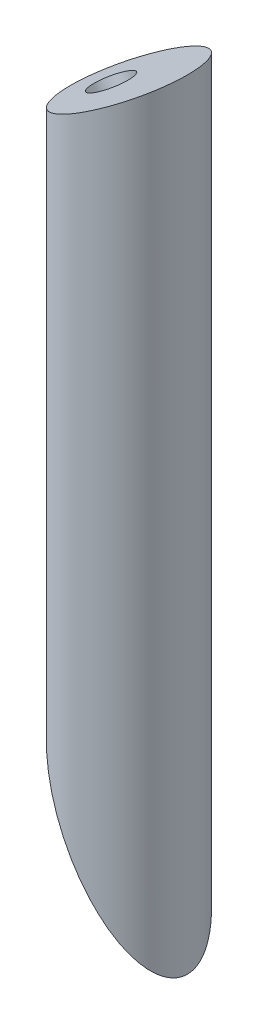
ISO-10303-21;
HEADER;
FILE_DESCRIPTION(('STEP AP214'),'2;1');
FILE_NAME('part.step','',(''),(''),'','','');
FILE_SCHEMA(('AUTOMOTIVE_DESIGN { 1 0 10303 214 1 1 1 1 }'));
ENDSEC;
DATA;
#1=APPLICATION_CONTEXT('core data for automotive mechanical design processes');
#2=APPLICATION_PROTOCOL_DEFINITION('international standard','automotive_design',2000,#1);
#3=PRODUCT_CONTEXT('',#1,'mechanical');
#4=PRODUCT('Part','Part','',(#3));
#5=PRODUCT_RELATED_PRODUCT_CATEGORY('part','',(#4));
#6=PRODUCT_DEFINITION_FORMATION('','',#4);
#7=PRODUCT_DEFINITION_CONTEXT('part definition',#1,'design');
#8=PRODUCT_DEFINITION('design','',#6,#7);
#9=PRODUCT_DEFINITION_SHAPE('','',#8);
#10=(LENGTH_UNIT() NAMED_UNIT(*) SI_UNIT(.MILLI.,.METRE.));
#11=(NAMED_UNIT(*) PLANE_ANGLE_UNIT() SI_UNIT($,.RADIAN.));
#12=(NAMED_UNIT(*) SI_UNIT($,.STERADIAN.) SOLID_ANGLE_UNIT());
#13=UNCERTAINTY_MEASURE_WITH_UNIT(LENGTH_MEASURE(1.E-05),#10,'distance_accuracy_value','');
#14=(GEOMETRIC_REPRESENTATION_CONTEXT(3) GLOBAL_UNCERTAINTY_ASSIGNED_CONTEXT((#13)) GLOBAL_UNIT_ASSIGNED_CONTEXT((#10,
#11,#12)) REPRESENTATION_CONTEXT('',''));
#15=CARTESIAN_POINT('',(0.,0.,0.));
#16=DIRECTION('',(0.,0.,1.));
#17=DIRECTION('',(1.,0.,0.));
#18=AXIS2_PLACEMENT_3D('',#15,#16,#17);
#19=CARTESIAN_POINT('',(0.,100.,0.));
#20=DIRECTION('',(0.,-1.,0.));
#21=DIRECTION('',(0.,0.,-1.));
#22=AXIS2_PLACEMENT_3D('',#19,#20,#21);
#23=CYLINDRICAL_SURFACE('',#22,7.5);
#24=CARTESIAN_POINT('',(0.,12.9903810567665,0.));
#25=DIRECTION('',(0.866025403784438,0.500000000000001,0.));
#26=DIRECTION('',(0.500000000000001,-0.866025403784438,0.));
#27=AXIS2_PLACEMENT_3D('',#24,#25,#26);
#28=ELLIPSE('',#27,15.,7.5);
#29=CARTESIAN_POINT('',(7.5,0.,0.));
#30=VERTEX_POINT('',#29);
#31=EDGE_CURVE('E37',#30,#30,#28,.T.);
#32=ORIENTED_EDGE('',*,*,#31,.T.);
#33=EDGE_LOOP('',(#32));
#34=FACE_BOUND('',#33,.T.);
#35=CARTESIAN_POINT('',(0.,95.6698729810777,0.));
#36=DIRECTION('',(-0.500000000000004,0.866025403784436,0.));
#37=DIRECTION('',(-0.866025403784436,-0.500000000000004,0.));
#38=AXIS2_PLACEMENT_3D('',#35,#36,#37);
#39=ELLIPSE('',#38,8.66025403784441,7.5);
#40=CARTESIAN_POINT('',(-7.5,91.3397459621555,0.));
#41=VERTEX_POINT('',#40);
#42=EDGE_CURVE('E10',#41,#41,#39,.T.);
#43=ORIENTED_EDGE('',*,*,#42,.F.);
#44=EDGE_LOOP('',(#43));
#45=FACE_BOUND('',#44,.T.);
#46=ADVANCED_FACE('F31',(#34,#45),#23,.T.);
#47=CARTESIAN_POINT('',(5.62499999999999,3.24759526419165,-50.));
#48=DIRECTION('',(0.866025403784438,0.500000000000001,0.));
#49=DIRECTION('',(-0.500000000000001,0.866025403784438,0.));
#50=AXIS2_PLACEMENT_3D('',#47,#48,#49);
#51=PLANE('',#50);
#52=CARTESIAN_POINT('',(-3.49999999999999,19.0525588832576,0.));
#53=DIRECTION('',(-0.866025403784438,-0.500000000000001,0.));
#54=DIRECTION('',(0.500000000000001,-0.866025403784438,0.));
#55=AXIS2_PLACEMENT_3D('',#52,#53,#54);
#56=CIRCLE('',#55,2.5);
#57=CARTESIAN_POINT('',(-2.24999999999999,16.8874953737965,0.));
#58=VERTEX_POINT('',#57);
#59=EDGE_CURVE('E51',#58,#58,#56,.T.);
#60=ORIENTED_EDGE('',*,*,#59,.F.);
#61=EDGE_LOOP('',(#60));
#62=FACE_BOUND('',#61,.T.);
#63=ORIENTED_EDGE('',*,*,#31,.F.);
#64=EDGE_LOOP('',(#63));
#65=FACE_BOUND('',#64,.T.);
#66=ADVANCED_FACE('F66',(#62,#65),#51,.F.);
#67=CARTESIAN_POINT('',(-41.4262701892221,71.7524047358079,-50.));
#68=DIRECTION('',(-0.500000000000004,0.866025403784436,0.));
#69=DIRECTION('',(-0.866025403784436,-0.500000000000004,0.));
#70=AXIS2_PLACEMENT_3D('',#67,#68,#69);
#71=PLANE('',#70);
#72=CARTESIAN_POINT('',(-2.30384757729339,94.3397459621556,0.));
#73=DIRECTION('',(-0.500000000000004,0.866025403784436,0.));
#74=DIRECTION('',(-0.866025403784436,-0.500000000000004,0.));
#75=AXIS2_PLACEMENT_3D('',#72,#73,#74);
#76=CIRCLE('',#75,2.5);
#77=CARTESIAN_POINT('',(-4.46891108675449,93.0897459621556,0.));
#78=VERTEX_POINT('',#77);
#79=EDGE_CURVE('E45',#78,#78,#76,.T.);
#80=ORIENTED_EDGE('',*,*,#79,.F.);
#81=EDGE_LOOP('',(#80));
#82=FACE_BOUND('',#81,.T.);
#83=ORIENTED_EDGE('',*,*,#42,.T.);
#84=EDGE_LOOP('',(#83));
#85=FACE_BOUND('',#84,.T.);
#86=ADVANCED_FACE('F69',(#82,#85),#71,.T.);
#87=CARTESIAN_POINT('',(2.69615242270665,85.6794919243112,0.));
#88=DIRECTION('',(-0.500000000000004,0.866025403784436,0.));
#89=DIRECTION('',(-0.866025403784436,-0.500000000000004,0.));
#90=AXIS2_PLACEMENT_3D('',#87,#88,#89);
#91=CYLINDRICAL_SURFACE('',#90,2.5);
#92=CARTESIAN_POINT('',(2.69615242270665,85.6794919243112,0.));
#93=DIRECTION('',(-0.500000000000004,0.866025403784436,0.));
#94=DIRECTION('',(-0.866025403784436,-0.500000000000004,0.));
#95=AXIS2_PLACEMENT_3D('',#92,#93,#94);
#96=CIRCLE('',#95,2.5);
#97=CARTESIAN_POINT('',(0.531088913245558,84.4294919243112,0.));
#98=VERTEX_POINT('',#97);
#99=EDGE_CURVE('E41',#98,#98,#96,.T.);
#100=ORIENTED_EDGE('',*,*,#99,.F.);
#101=EDGE_LOOP('',(#100));
#102=FACE_BOUND('',#101,.T.);
#103=ORIENTED_EDGE('',*,*,#79,.T.);
#104=EDGE_LOOP('',(#103));
#105=FACE_BOUND('',#104,.T.);
#106=ADVANCED_FACE('F74',(#102,#105),#91,.F.);
#107=CARTESIAN_POINT('',(2.69615242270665,85.6794919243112,0.));
#108=DIRECTION('',(-0.500000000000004,0.866025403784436,0.));
#109=DIRECTION('',(-0.866025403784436,-0.500000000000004,0.));
#110=AXIS2_PLACEMENT_3D('',#107,#108,#109);
#111=PLANE('',#110);
#112=ORIENTED_EDGE('',*,*,#99,.T.);
#113=EDGE_LOOP('',(#112));
#114=FACE_BOUND('',#113,.T.);
#115=ADVANCED_FACE('F62',(#114),#111,.T.);
#116=CARTESIAN_POINT('',(5.16025403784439,24.0525588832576,0.));
#117=DIRECTION('',(-0.866025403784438,-0.500000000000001,0.));
#118=DIRECTION('',(0.500000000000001,-0.866025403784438,0.));
#119=AXIS2_PLACEMENT_3D('',#116,#117,#118);
#120=CYLINDRICAL_SURFACE('',#119,2.5);
#121=CARTESIAN_POINT('',(5.16025403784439,24.0525588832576,0.));
#122=DIRECTION('',(-0.866025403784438,-0.500000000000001,0.));
#123=DIRECTION('',(0.500000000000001,-0.866025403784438,0.));
#124=AXIS2_PLACEMENT_3D('',#121,#122,#123);
#125=CIRCLE('',#124,2.5);
#126=CARTESIAN_POINT('',(6.41025403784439,21.8874953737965,0.));
#127=VERTEX_POINT('',#126);
#128=EDGE_CURVE('E49',#127,#127,#125,.T.);
#129=ORIENTED_EDGE('',*,*,#128,.F.);
#130=EDGE_LOOP('',(#129));
#131=FACE_BOUND('',#130,.T.);
#132=ORIENTED_EDGE('',*,*,#59,.T.);
#133=EDGE_LOOP('',(#132));
#134=FACE_BOUND('',#133,.T.);
#135=ADVANCED_FACE('F59',(#131,#134),#120,.F.);
#136=CARTESIAN_POINT('',(5.16025403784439,24.0525588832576,0.));
#137=DIRECTION('',(-0.866025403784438,-0.500000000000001,0.));
#138=DIRECTION('',(0.500000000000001,-0.866025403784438,0.));
#139=AXIS2_PLACEMENT_3D('',#136,#137,#138);
#140=PLANE('',#139);
#141=ORIENTED_EDGE('',*,*,#128,.T.);
#142=EDGE_LOOP('',(#141));
#143=FACE_BOUND('',#142,.T.);
#144=ADVANCED_FACE('F57',(#143),#140,.T.);
#145=CLOSED_SHELL('',(#46,#66,#86,#106,#115,#135,#144));
#146=MANIFOLD_SOLID_BREP('B2',#145);
#147=ADVANCED_BREP_SHAPE_REPRESENTATION('',(#18,#146),#14);
#148=SHAPE_DEFINITION_REPRESENTATION(#9,#147);
ENDSEC;
END-ISO-10303-21;
